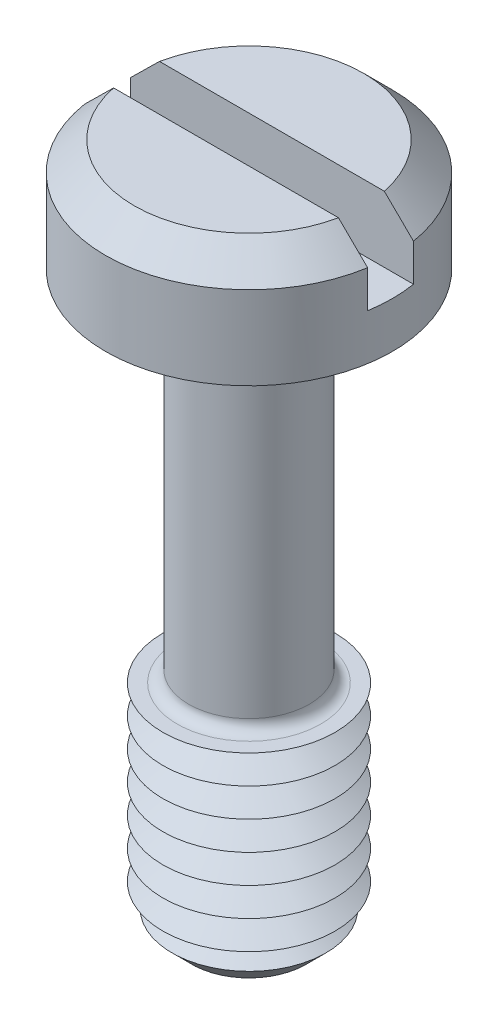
from build123d import *

# Parameters (mm, degrees)
SKETCH1_R           = 5
BOSS_EXTRUDE1_DEPTH = 3.9
SKETCH2_R           = 2.1
BOSS_EXTRUDE2_DEPTH = 20
SKETCH3_R           = 3
BOSS_EXTRUDE3_DEPTH = 7.5
CHAMFER1_SIZE       = 1
LPATTERN1_COUNT     = 7
LPATTERN1_PITCH     = 1
FILLET1_R           = 0.4
CHAMFER2_SIZE       = 1
SKETCH6_W           = 10
SKETCH6_H           = 1.6
CUT_EXTRUDE1_DEPTH  = 2.3


with BuildPart() as part:
    # Sketch1 → Boss-Extrude1 (new body)
    with BuildSketch(Plane(origin=(0, 0, 0), x_dir=(1, 0, 0), z_dir=(0, 1, 0))):
        with Locations(Location((0, 0, 0), (0, 0, 270))):
            Circle(SKETCH1_R)
    extrude(amount=BOSS_EXTRUDE1_DEPTH)

    # Sketch2 → Boss-Extrude2 (add)
    with BuildSketch(Plane.XZ):
        with Locations(Location((0, 0, 0), (0, 0, 270))):
            Circle(SKETCH2_R)
    extrude(amount=BOSS_EXTRUDE2_DEPTH)

    # Sketch3 → Boss-Extrude3 (add)
    with BuildSketch(Plane.XZ.offset(20)):
        with Locations(Location((0, 0, 0), (0, 0, 270))):
            Circle(SKETCH3_R)
    extrude(amount=-BOSS_EXTRUDE3_DEPTH)

    # Chamfer1
    chamfer1_edges = [part.edges().sort_by_distance(p)[0] for p in [
        (0, -20, 3),
    ]]
    chamfer(chamfer1_edges, length=CHAMFER1_SIZE)

    # Sketch5 → Cut-Revolve1 (revolve, cut)
    with BuildSketch(Plane(origin=(0, 0, 0), x_dir=(0, 0, -1), z_dir=(1, 0, 0))):
        Polygon((-3, -12.5), (-2.133974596, -13), (-3, -13.5), align=None)
    cut_revolve1 = revolve(axis=Axis((0, -6.58711856, 0), (0, -1, 0)), mode=Mode.SUBTRACT)

    # LPattern1: Cut-Revolve1 ×7
    with Locations(*[(0, -i * LPATTERN1_PITCH, 0) for i in range(1, LPATTERN1_COUNT)]):
        add(cut_revolve1, mode=Mode.SUBTRACT)

    # Fillet1
    fillet1_edges = [part.edges().sort_by_distance(p)[0] for p in [
        (0, 0, 2.1),
        (0, -12.5, 2.1),
    ]]
    fillet(fillet1_edges, radius=FILLET1_R)

    # Chamfer2
    chamfer2_edges = [part.edges().sort_by_distance(p)[0] for p in [
        (0, 3.9, -5),
    ]]
    chamfer(chamfer2_edges, length=CHAMFER2_SIZE)

    # Sketch6 → Cut-Extrude1 (cut)
    with BuildSketch(Plane(origin=(0, 3.9, 0), x_dir=(1, 0, 0), z_dir=(0, 1, 0))):
        Rectangle(SKETCH6_W, SKETCH6_H)
    extrude(amount=-CUT_EXTRUDE1_DEPTH, mode=Mode.SUBTRACT)


solid = part.part
